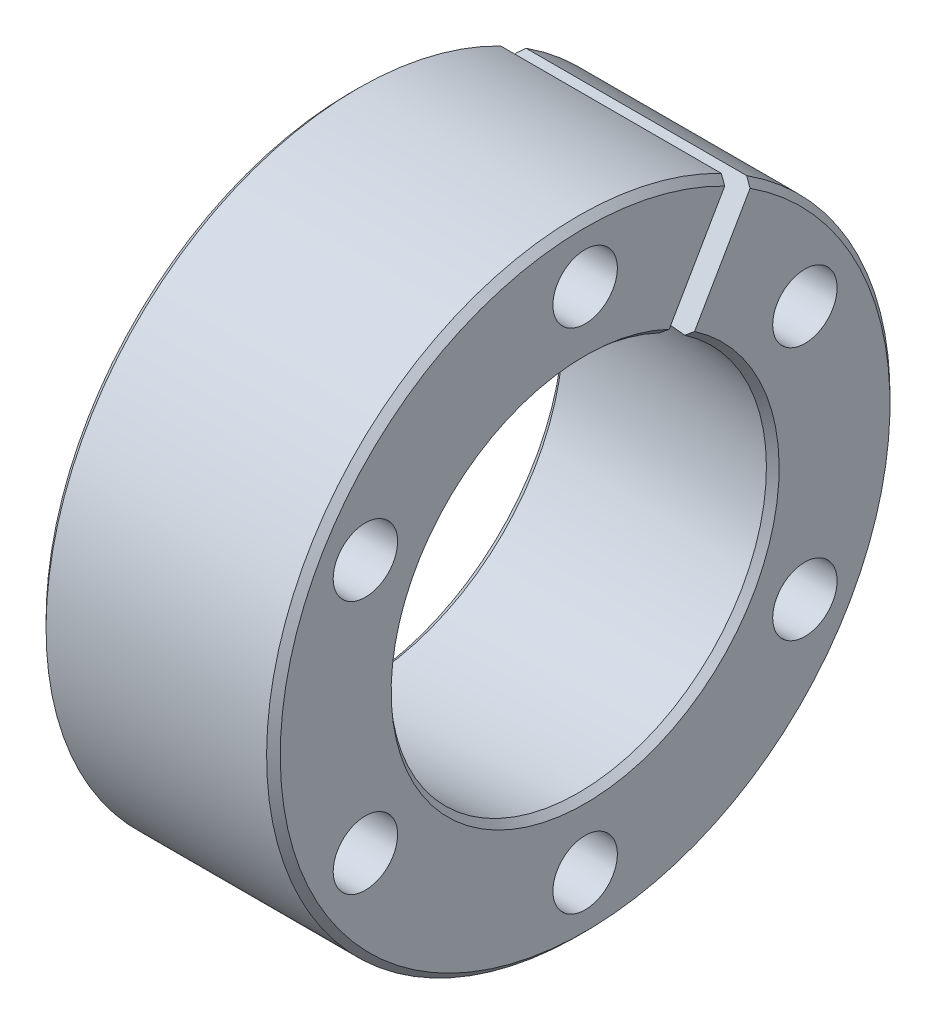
ISO-10303-21;
HEADER;
FILE_DESCRIPTION(('STEP AP214'),'2;1');
FILE_NAME('part.step','',(''),(''),'','','');
FILE_SCHEMA(('AUTOMOTIVE_DESIGN { 1 0 10303 214 1 1 1 1 }'));
ENDSEC;
DATA;
#1=APPLICATION_CONTEXT('core data for automotive mechanical design processes');
#2=APPLICATION_PROTOCOL_DEFINITION('international standard','automotive_design',2000,#1);
#3=PRODUCT_CONTEXT('',#1,'mechanical');
#4=PRODUCT('Part','Part','',(#3));
#5=PRODUCT_RELATED_PRODUCT_CATEGORY('part','',(#4));
#6=PRODUCT_DEFINITION_FORMATION('','',#4);
#7=PRODUCT_DEFINITION_CONTEXT('part definition',#1,'design');
#8=PRODUCT_DEFINITION('design','',#6,#7);
#9=PRODUCT_DEFINITION_SHAPE('','',#8);
#10=(LENGTH_UNIT() NAMED_UNIT(*) SI_UNIT(.MILLI.,.METRE.));
#11=(NAMED_UNIT(*) PLANE_ANGLE_UNIT() SI_UNIT($,.RADIAN.));
#12=(NAMED_UNIT(*) SI_UNIT($,.STERADIAN.) SOLID_ANGLE_UNIT());
#13=UNCERTAINTY_MEASURE_WITH_UNIT(LENGTH_MEASURE(1.E-05),#10,'distance_accuracy_value','');
#14=(GEOMETRIC_REPRESENTATION_CONTEXT(3) GLOBAL_UNCERTAINTY_ASSIGNED_CONTEXT((#13)) GLOBAL_UNIT_ASSIGNED_CONTEXT((#10,
#11,#12)) REPRESENTATION_CONTEXT('',''));
#15=CARTESIAN_POINT('',(0.,0.,0.));
#16=DIRECTION('',(0.,0.,1.));
#17=DIRECTION('',(1.,0.,0.));
#18=AXIS2_PLACEMENT_3D('',#15,#16,#17);
#19=CARTESIAN_POINT('',(0.,0.,0.));
#20=DIRECTION('',(-1.,0.,0.));
#21=DIRECTION('',(0.,0.,1.));
#22=AXIS2_PLACEMENT_3D('',#19,#20,#21);
#23=CYLINDRICAL_SURFACE('',#22,15.97);
#24=CARTESIAN_POINT('',(11.65,0.,0.));
#25=DIRECTION('',(-1.,0.,0.));
#26=DIRECTION('',(0.,0.,1.));
#27=AXIS2_PLACEMENT_3D('',#24,#25,#26);
#28=CIRCLE('',#27,15.97);
#29=CARTESIAN_POINT('',(11.65,13.4401655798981,-8.62570861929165));
#30=VERTEX_POINT('',#29);
#31=CARTESIAN_POINT('',(11.65,14.1901655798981,-7.32667051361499));
#32=VERTEX_POINT('',#31);
#33=EDGE_CURVE('E146',#30,#32,#28,.T.);
#34=ORIENTED_EDGE('',*,*,#33,.T.);
#35=DIRECTION('',(-1.,0.,0.));
#36=VECTOR('',#35,1.);
#37=CARTESIAN_POINT('',(0.,14.1901655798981,-7.32667051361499));
#38=LINE('',#37,#36);
#39=CARTESIAN_POINT('',(0.350000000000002,14.1901655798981,-7.32667051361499));
#40=VERTEX_POINT('',#39);
#41=EDGE_CURVE('E119',#32,#40,#38,.T.);
#42=ORIENTED_EDGE('',*,*,#41,.T.);
#43=CARTESIAN_POINT('',(0.35,0.,0.));
#44=DIRECTION('',(1.,0.,0.));
#45=DIRECTION('',(0.,0.,-1.));
#46=AXIS2_PLACEMENT_3D('',#43,#44,#45);
#47=CIRCLE('',#46,15.97);
#48=CARTESIAN_POINT('',(0.35,13.4401655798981,-8.62570861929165));
#49=VERTEX_POINT('',#48);
#50=EDGE_CURVE('E138',#40,#49,#47,.T.);
#51=ORIENTED_EDGE('',*,*,#50,.T.);
#52=DIRECTION('',(-1.,0.,0.));
#53=VECTOR('',#52,1.);
#54=CARTESIAN_POINT('',(0.,13.4401655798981,-8.62570861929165));
#55=LINE('',#54,#53);
#56=EDGE_CURVE('E129',#30,#49,#55,.T.);
#57=ORIENTED_EDGE('',*,*,#56,.F.);
#58=EDGE_LOOP('',(#34,#42,#51,#57));
#59=FACE_BOUND('',#58,.T.);
#60=ADVANCED_FACE('F39',(#59),#23,.T.);
#61=CARTESIAN_POINT('',(0.,10.4724573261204,0.));
#62=DIRECTION('',(1.,0.,0.));
#63=DIRECTION('',(0.,0.,-1.));
#64=AXIS2_PLACEMENT_3D('',#61,#62,#63);
#65=PLANE('',#64);
#66=CARTESIAN_POINT('',(0.,6.50000000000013,11.2583302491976));
#67=DIRECTION('',(-1.,0.,0.));
#68=DIRECTION('',(0.,0.,1.));
#69=AXIS2_PLACEMENT_3D('',#66,#67,#68);
#70=CIRCLE('',#69,1.65);
#71=CARTESIAN_POINT('',(0.,6.50000000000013,12.9083302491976));
#72=VERTEX_POINT('',#71);
#73=EDGE_CURVE('E220',#72,#72,#70,.T.);
#74=ORIENTED_EDGE('',*,*,#73,.F.);
#75=EDGE_LOOP('',(#74));
#76=FACE_BOUND('',#75,.T.);
#77=CARTESIAN_POINT('',(0.,-6.49999999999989,11.2583302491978));
#78=DIRECTION('',(-1.,0.,0.));
#79=DIRECTION('',(0.,0.,1.));
#80=AXIS2_PLACEMENT_3D('',#77,#78,#79);
#81=CIRCLE('',#80,1.65);
#82=CARTESIAN_POINT('',(0.,-6.49999999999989,12.9083302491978));
#83=VERTEX_POINT('',#82);
#84=EDGE_CURVE('E231',#83,#83,#81,.T.);
#85=ORIENTED_EDGE('',*,*,#84,.F.);
#86=EDGE_LOOP('',(#85));
#87=FACE_BOUND('',#86,.T.);
#88=CARTESIAN_POINT('',(0.,-13.,0.));
#89=DIRECTION('',(-1.,0.,0.));
#90=DIRECTION('',(0.,0.,1.));
#91=AXIS2_PLACEMENT_3D('',#88,#89,#90);
#92=CIRCLE('',#91,1.65);
#93=CARTESIAN_POINT('',(0.,-13.,1.65));
#94=VERTEX_POINT('',#93);
#95=EDGE_CURVE('E237',#94,#94,#92,.T.);
#96=ORIENTED_EDGE('',*,*,#95,.F.);
#97=EDGE_LOOP('',(#96));
#98=FACE_BOUND('',#97,.T.);
#99=CARTESIAN_POINT('',(0.,-6.50000000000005,-11.2583302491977));
#100=DIRECTION('',(-1.,0.,0.));
#101=DIRECTION('',(0.,0.,1.));
#102=AXIS2_PLACEMENT_3D('',#99,#100,#101);
#103=CIRCLE('',#102,1.65);
#104=CARTESIAN_POINT('',(0.,-6.50000000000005,-9.60833024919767));
#105=VERTEX_POINT('',#104);
#106=EDGE_CURVE('E243',#105,#105,#103,.T.);
#107=ORIENTED_EDGE('',*,*,#106,.F.);
#108=EDGE_LOOP('',(#107));
#109=FACE_BOUND('',#108,.T.);
#110=CARTESIAN_POINT('',(0.,6.49999999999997,-11.2583302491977));
#111=DIRECTION('',(-1.,0.,0.));
#112=DIRECTION('',(0.,0.,1.));
#113=AXIS2_PLACEMENT_3D('',#110,#111,#112);
#114=CIRCLE('',#113,1.65);
#115=CARTESIAN_POINT('',(0.,6.49999999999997,-9.60833024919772));
#116=VERTEX_POINT('',#115);
#117=EDGE_CURVE('E249',#116,#116,#114,.T.);
#118=ORIENTED_EDGE('',*,*,#117,.F.);
#119=EDGE_LOOP('',(#118));
#120=FACE_BOUND('',#119,.T.);
#121=CARTESIAN_POINT('',(0.,13.,0.));
#122=DIRECTION('',(-1.,0.,0.));
#123=DIRECTION('',(0.,0.,1.));
#124=AXIS2_PLACEMENT_3D('',#121,#122,#123);
#125=CIRCLE('',#124,1.65);
#126=CARTESIAN_POINT('',(0.,13.,1.65));
#127=VERTEX_POINT('',#126);
#128=EDGE_CURVE('E255',#127,#127,#125,.T.);
#129=ORIENTED_EDGE('',*,*,#128,.F.);
#130=EDGE_LOOP('',(#129));
#131=FACE_BOUND('',#130,.T.);
#132=DIRECTION('',(0.,-0.866025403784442,0.499999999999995));
#133=VECTOR('',#132,1.);
#134=CARTESIAN_POINT('',(0.,0.374999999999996,0.649519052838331));
#135=LINE('',#134,#133);
#136=CARTESIAN_POINT('',(0.,9.76839508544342,-4.77376012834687));
#137=VERTEX_POINT('',#136);
#138=CARTESIAN_POINT('',(0.,13.8867143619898,-7.1514728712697));
#139=VERTEX_POINT('',#138);
#140=EDGE_CURVE('E270',#137,#139,#135,.F.);
#141=ORIENTED_EDGE('',*,*,#140,.F.);
#142=CARTESIAN_POINT('',(0.,0.,0.));
#143=DIRECTION('',(1.,0.,0.));
#144=DIRECTION('',(0.,0.,-1.));
#145=AXIS2_PLACEMENT_3D('',#142,#143,#144);
#146=CIRCLE('',#145,10.8724573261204);
#147=CARTESIAN_POINT('',(0.,9.01839508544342,-6.07279823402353));
#148=VERTEX_POINT('',#147);
#149=EDGE_CURVE('E54',#137,#148,#146,.T.);
#150=ORIENTED_EDGE('',*,*,#149,.T.);
#151=DIRECTION('',(0.,-0.866025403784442,0.499999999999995));
#152=VECTOR('',#151,1.);
#153=CARTESIAN_POINT('',(0.,13.1367143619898,-8.45051097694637));
#154=LINE('',#153,#152);
#155=CARTESIAN_POINT('',(0.,13.1367143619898,-8.45051097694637));
#156=VERTEX_POINT('',#155);
#157=EDGE_CURVE('E286',#148,#156,#154,.F.);
#158=ORIENTED_EDGE('',*,*,#157,.T.);
#159=CARTESIAN_POINT('',(0.,0.,0.));
#160=DIRECTION('',(1.,0.,0.));
#161=DIRECTION('',(0.,0.,-1.));
#162=AXIS2_PLACEMENT_3D('',#159,#160,#161);
#163=CIRCLE('',#162,15.62);
#164=EDGE_CURVE('E149',#156,#139,#163,.F.);
#165=ORIENTED_EDGE('',*,*,#164,.T.);
#166=EDGE_LOOP('',(#141,#150,#158,#165));
#167=FACE_BOUND('',#166,.T.);
#168=ADVANCED_FACE('F209',(#76,#87,#98,#109,#120,#131,#167),#65,.F.);
#169=CARTESIAN_POINT('',(12.,15.97,0.));
#170=DIRECTION('',(-1.,0.,0.));
#171=DIRECTION('',(0.,0.,1.));
#172=AXIS2_PLACEMENT_3D('',#169,#170,#171);
#173=PLANE('',#172);
#174=CARTESIAN_POINT('',(12.,6.50000000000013,11.2583302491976));
#175=DIRECTION('',(-1.,0.,0.));
#176=DIRECTION('',(0.,0.,1.));
#177=AXIS2_PLACEMENT_3D('',#174,#175,#176);
#178=CIRCLE('',#177,1.65);
#179=CARTESIAN_POINT('',(12.,6.50000000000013,12.9083302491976));
#180=VERTEX_POINT('',#179);
#181=EDGE_CURVE('E228',#180,#180,#178,.T.);
#182=ORIENTED_EDGE('',*,*,#181,.T.);
#183=EDGE_LOOP('',(#182));
#184=FACE_BOUND('',#183,.T.);
#185=CARTESIAN_POINT('',(12.,-6.49999999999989,11.2583302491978));
#186=DIRECTION('',(-1.,0.,0.));
#187=DIRECTION('',(0.,0.,1.));
#188=AXIS2_PLACEMENT_3D('',#185,#186,#187);
#189=CIRCLE('',#188,1.65);
#190=CARTESIAN_POINT('',(12.,-6.49999999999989,12.9083302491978));
#191=VERTEX_POINT('',#190);
#192=EDGE_CURVE('E234',#191,#191,#189,.T.);
#193=ORIENTED_EDGE('',*,*,#192,.T.);
#194=EDGE_LOOP('',(#193));
#195=FACE_BOUND('',#194,.T.);
#196=CARTESIAN_POINT('',(12.,-13.,0.));
#197=DIRECTION('',(-1.,0.,0.));
#198=DIRECTION('',(0.,0.,1.));
#199=AXIS2_PLACEMENT_3D('',#196,#197,#198);
#200=CIRCLE('',#199,1.65);
#201=CARTESIAN_POINT('',(12.,-13.,1.65));
#202=VERTEX_POINT('',#201);
#203=EDGE_CURVE('E240',#202,#202,#200,.T.);
#204=ORIENTED_EDGE('',*,*,#203,.T.);
#205=EDGE_LOOP('',(#204));
#206=FACE_BOUND('',#205,.T.);
#207=CARTESIAN_POINT('',(12.,-6.50000000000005,-11.2583302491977));
#208=DIRECTION('',(-1.,0.,0.));
#209=DIRECTION('',(0.,0.,1.));
#210=AXIS2_PLACEMENT_3D('',#207,#208,#209);
#211=CIRCLE('',#210,1.65);
#212=CARTESIAN_POINT('',(12.,-6.50000000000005,-9.60833024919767));
#213=VERTEX_POINT('',#212);
#214=EDGE_CURVE('E246',#213,#213,#211,.T.);
#215=ORIENTED_EDGE('',*,*,#214,.T.);
#216=EDGE_LOOP('',(#215));
#217=FACE_BOUND('',#216,.T.);
#218=CARTESIAN_POINT('',(12.,6.49999999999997,-11.2583302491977));
#219=DIRECTION('',(-1.,0.,0.));
#220=DIRECTION('',(0.,0.,1.));
#221=AXIS2_PLACEMENT_3D('',#218,#219,#220);
#222=CIRCLE('',#221,1.65);
#223=CARTESIAN_POINT('',(12.,6.49999999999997,-9.60833024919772));
#224=VERTEX_POINT('',#223);
#225=EDGE_CURVE('E252',#224,#224,#222,.T.);
#226=ORIENTED_EDGE('',*,*,#225,.T.);
#227=EDGE_LOOP('',(#226));
#228=FACE_BOUND('',#227,.T.);
#229=CARTESIAN_POINT('',(12.,13.,0.));
#230=DIRECTION('',(-1.,0.,0.));
#231=DIRECTION('',(0.,0.,1.));
#232=AXIS2_PLACEMENT_3D('',#229,#230,#231);
#233=CIRCLE('',#232,1.65);
#234=CARTESIAN_POINT('',(12.,13.,1.65));
#235=VERTEX_POINT('',#234);
#236=EDGE_CURVE('E140',#235,#235,#233,.T.);
#237=ORIENTED_EDGE('',*,*,#236,.T.);
#238=EDGE_LOOP('',(#237));
#239=FACE_BOUND('',#238,.T.);
#240=CARTESIAN_POINT('',(12.,0.,0.));
#241=DIRECTION('',(-1.,0.,0.));
#242=DIRECTION('',(0.,0.,1.));
#243=AXIS2_PLACEMENT_3D('',#240,#241,#242);
#244=CIRCLE('',#243,9.93971434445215);
#245=CARTESIAN_POINT('',(12.,8.20850545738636,-5.6052082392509));
#246=VERTEX_POINT('',#245);
#247=CARTESIAN_POINT('',(12.,8.95850545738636,-4.30617013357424));
#248=VERTEX_POINT('',#247);
#249=EDGE_CURVE('E126',#246,#248,#244,.T.);
#250=ORIENTED_EDGE('',*,*,#249,.T.);
#251=DIRECTION('',(0.,0.866025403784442,-0.499999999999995));
#252=VECTOR('',#251,1.);
#253=CARTESIAN_POINT('',(12.,0.374999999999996,0.649519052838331));
#254=LINE('',#253,#252);
#255=CARTESIAN_POINT('',(12.,13.8867143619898,-7.15147287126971));
#256=VERTEX_POINT('',#255);
#257=EDGE_CURVE('E130',#248,#256,#254,.T.);
#258=ORIENTED_EDGE('',*,*,#257,.T.);
#259=CARTESIAN_POINT('',(12.,0.,0.));
#260=DIRECTION('',(-1.,0.,0.));
#261=DIRECTION('',(0.,0.,1.));
#262=AXIS2_PLACEMENT_3D('',#259,#260,#261);
#263=CIRCLE('',#262,15.62);
#264=CARTESIAN_POINT('',(12.,13.1367143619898,-8.45051097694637));
#265=VERTEX_POINT('',#264);
#266=EDGE_CURVE('E128',#256,#265,#263,.F.);
#267=ORIENTED_EDGE('',*,*,#266,.T.);
#268=DIRECTION('',(0.,0.866025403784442,-0.499999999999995));
#269=VECTOR('',#268,1.);
#270=CARTESIAN_POINT('',(12.,-0.374999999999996,-0.649519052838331));
#271=LINE('',#270,#269);
#272=EDGE_CURVE('E111',#246,#265,#271,.T.);
#273=ORIENTED_EDGE('',*,*,#272,.F.);
#274=EDGE_LOOP('',(#250,#258,#267,#273));
#275=FACE_BOUND('',#274,.T.);
#276=ADVANCED_FACE('F124',(#184,#195,#206,#217,#228,#239,#275),#173,.F.);
#277=CARTESIAN_POINT('',(0.,0.,0.));
#278=DIRECTION('',(-1.,0.,0.));
#279=DIRECTION('',(0.,0.,1.));
#280=AXIS2_PLACEMENT_3D('',#277,#278,#279);
#281=CONICAL_SURFACE('',#280,10.4724573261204,0.0715584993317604);
#282=CARTESIAN_POINT('',(-0.000199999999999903,8.67113851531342,-5.87230955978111));
#283=CARTESIAN_POINT('',(1.94168494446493,8.55028200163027,-5.80253301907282));
#284=CARTESIAN_POINT('',(3.88356872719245,8.42941149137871,-5.73274839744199));
#285=CARTESIAN_POINT('',(7.76733396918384,8.18764247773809,-5.59316299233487));
#286=CARTESIAN_POINT('',(9.70921542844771,8.06674397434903,-5.52336220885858));
#287=CARTESIAN_POINT('',(11.6510957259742,7.94583147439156,-5.45355334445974));
#288=B_SPLINE_CURVE_WITH_KNOTS('',3,(#282,#283,#284,#285,#286,#287),.UNSPECIFIED.,.F.,.F.,(4,2,
4),(0.,5.84067888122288,11.6813577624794),.UNSPECIFIED.);
#289=CARTESIAN_POINT('',(0.430886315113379,8.64430866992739,-5.85681934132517));
#290=VERTEX_POINT('',#289);
#291=CARTESIAN_POINT('',(11.6508957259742,7.9458439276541,-5.45356053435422));
#292=VERTEX_POINT('',#291);
#293=EDGE_CURVE('E114',#290,#292,#288,.T.);
#294=ORIENTED_EDGE('',*,*,#293,.F.);
#295=CARTESIAN_POINT('',(0.430886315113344,0.,0.));
#296=DIRECTION('',(1.,0.,0.));
#297=DIRECTION('',(0.,0.,-1.));
#298=AXIS2_PLACEMENT_3D('',#295,#296,#297);
#299=CIRCLE('',#298,10.441571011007);
#300=CARTESIAN_POINT('',(0.430886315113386,9.39430866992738,-4.5577812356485));
#301=VERTEX_POINT('',#300);
#302=EDGE_CURVE('E279',#290,#301,#299,.F.);
#303=ORIENTED_EDGE('',*,*,#302,.T.);
#304=CARTESIAN_POINT('',(-0.000199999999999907,9.42113851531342,-4.57327145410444));
#305=CARTESIAN_POINT('',(1.94168494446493,9.30028200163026,-4.50349491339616));
#306=CARTESIAN_POINT('',(3.88356872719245,9.1794114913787,-4.43371029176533));
#307=CARTESIAN_POINT('',(7.76733396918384,8.93764247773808,-4.29412488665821));
#308=CARTESIAN_POINT('',(9.70921542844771,8.81674397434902,-4.22432410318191));
#309=CARTESIAN_POINT('',(11.6510957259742,8.69583147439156,-4.15451523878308));
#310=B_SPLINE_CURVE_WITH_KNOTS('',3,(#304,#305,#306,#307,#308,#309),.UNSPECIFIED.,.F.,.F.,(4,2,
4),(0.,5.84067888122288,11.6813577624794),.UNSPECIFIED.);
#311=CARTESIAN_POINT('',(11.6508957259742,8.69584392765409,-4.15452242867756));
#312=VERTEX_POINT('',#311);
#313=EDGE_CURVE('E221',#301,#312,#310,.T.);
#314=ORIENTED_EDGE('',*,*,#313,.T.);
#315=CARTESIAN_POINT('',(11.6508957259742,0.,0.));
#316=DIRECTION('',(1.,0.,0.));
#317=DIRECTION('',(0.,0.,-1.));
#318=AXIS2_PLACEMENT_3D('',#315,#316,#317);
#319=CIRCLE('',#318,9.63731073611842);
#320=EDGE_CURVE('E136',#312,#292,#319,.T.);
#321=ORIENTED_EDGE('',*,*,#320,.T.);
#322=EDGE_LOOP('',(#294,#303,#314,#321));
#323=FACE_BOUND('',#322,.T.);
#324=ADVANCED_FACE('F208',(#323),#281,.F.);
#325=CARTESIAN_POINT('',(12.,0.,0.));
#326=DIRECTION('',(1.,0.,0.));
#327=DIRECTION('',(0.,0.,-1.));
#328=AXIS2_PLACEMENT_3D('',#325,#326,#327);
#329=CONICAL_SURFACE('',#328,9.93971434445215,0.713839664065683);
#330=CARTESIAN_POINT('',(12.0002,8.95865592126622,-4.30625700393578));
#331=CARTESIAN_POINT('',(11.9419469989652,8.91483112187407,-4.28095474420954));
#332=CARTESIAN_POINT('',(11.8836951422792,8.87100518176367,-4.25565182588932));
#333=CARTESIAN_POINT('',(11.7671937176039,8.78335102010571,-4.2050446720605));
#334=CARTESIAN_POINT('',(11.7089441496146,8.73952279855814,-4.17974043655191));
#335=CARTESIAN_POINT('',(11.6506957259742,8.69569343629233,-4.15443554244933));
#336=B_SPLINE_CURVE_WITH_KNOTS('',3,(#330,#331,#332,#333,#334,#335),.UNSPECIFIED.,.F.,.F.,(4,2,
4),(0.,0.231490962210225,0.462981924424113),.UNSPECIFIED.);
#337=EDGE_CURVE('E135',#248,#312,#336,.T.);
#338=ORIENTED_EDGE('',*,*,#337,.F.);
#339=ORIENTED_EDGE('',*,*,#249,.F.);
#340=CARTESIAN_POINT('',(12.0002,8.20865592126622,-5.60529510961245));
#341=CARTESIAN_POINT('',(11.9419469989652,8.16483112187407,-5.5799928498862));
#342=CARTESIAN_POINT('',(11.8836951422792,8.12100518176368,-5.55468993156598));
#343=CARTESIAN_POINT('',(11.7671937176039,8.03335102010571,-5.50408277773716));
#344=CARTESIAN_POINT('',(11.7089441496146,7.98952279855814,-5.47877854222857));
#345=CARTESIAN_POINT('',(11.6506957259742,7.94569343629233,-5.453473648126));
#346=B_SPLINE_CURVE_WITH_KNOTS('',3,(#340,#341,#342,#343,#344,#345),.UNSPECIFIED.,.F.,.F.,(4,2,
4),(0.,0.231490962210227,0.462981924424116),.UNSPECIFIED.);
#347=EDGE_CURVE('E108',#246,#292,#346,.T.);
#348=ORIENTED_EDGE('',*,*,#347,.T.);
#349=ORIENTED_EDGE('',*,*,#320,.F.);
#350=EDGE_LOOP('',(#338,#339,#348,#349));
#351=FACE_BOUND('',#350,.T.);
#352=ADVANCED_FACE('F133',(#351),#329,.F.);
#353=CARTESIAN_POINT('',(11.65,0.,0.));
#354=DIRECTION('',(-1.,0.,0.));
#355=DIRECTION('',(0.,0.,1.));
#356=AXIS2_PLACEMENT_3D('',#353,#354,#355);
#357=CONICAL_SURFACE('',#356,15.97,0.785398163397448);
#358=CARTESIAN_POINT('',(11.6498,14.1903389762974,-7.32677062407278));
#359=CARTESIAN_POINT('',(11.7082007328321,14.1397066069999,-7.29753801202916));
#360=CARTESIAN_POINT('',(11.7666010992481,14.0890739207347,-7.26830521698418));
#361=CARTESIAN_POINT('',(11.8834010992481,13.9878079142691,-7.20983926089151));
#362=CARTESIAN_POINT('',(11.9418007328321,13.9371745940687,-7.18060609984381));
#363=CARTESIAN_POINT('',(12.0002,13.8865409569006,-7.15137275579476));
#364=B_SPLINE_CURVE_WITH_KNOTS('',3,(#358,#359,#360,#361,#362,#363),.UNSPECIFIED.,.F.,.F.,(4,2,
4),(0.,0.247910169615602,0.495820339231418),.UNSPECIFIED.);
#365=EDGE_CURVE('E273',#32,#256,#364,.T.);
#366=ORIENTED_EDGE('',*,*,#365,.F.);
#367=ORIENTED_EDGE('',*,*,#33,.F.);
#368=CARTESIAN_POINT('',(11.6498,13.4403389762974,-8.62580872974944));
#369=CARTESIAN_POINT('',(11.7082007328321,13.3897066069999,-8.59657611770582));
#370=CARTESIAN_POINT('',(11.7666010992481,13.3390739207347,-8.56734332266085));
#371=CARTESIAN_POINT('',(11.8834010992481,13.2378079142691,-8.50887736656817));
#372=CARTESIAN_POINT('',(11.9418007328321,13.1871745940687,-8.47964420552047));
#373=CARTESIAN_POINT('',(12.0002,13.1365409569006,-8.45041086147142));
#374=B_SPLINE_CURVE_WITH_KNOTS('',3,(#368,#369,#370,#371,#372,#373),.UNSPECIFIED.,.F.,.F.,(4,2,
4),(0.,0.247910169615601,0.495820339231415),.UNSPECIFIED.);
#375=EDGE_CURVE('E181',#30,#265,#374,.T.);
#376=ORIENTED_EDGE('',*,*,#375,.T.);
#377=ORIENTED_EDGE('',*,*,#266,.F.);
#378=EDGE_LOOP('',(#366,#367,#376,#377));
#379=FACE_BOUND('',#378,.T.);
#380=ADVANCED_FACE('F207',(#379),#357,.T.);
#381=CARTESIAN_POINT('',(0.,0.,0.));
#382=DIRECTION('',(1.,0.,0.));
#383=DIRECTION('',(0.,0.,-1.));
#384=AXIS2_PLACEMENT_3D('',#381,#382,#383);
#385=CONICAL_SURFACE('',#384,15.62,0.785398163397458);
#386=CARTESIAN_POINT('',(-0.000200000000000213,13.8865409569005,-7.15137275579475));
#387=CARTESIAN_POINT('',(0.0581992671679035,13.9371745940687,-7.18060609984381));
#388=CARTESIAN_POINT('',(0.116598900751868,13.9878079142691,-7.20983926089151));
#389=CARTESIAN_POINT('',(0.233398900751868,14.0890739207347,-7.26830521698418));
#390=CARTESIAN_POINT('',(0.291799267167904,14.1397066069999,-7.29753801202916));
#391=CARTESIAN_POINT('',(0.350200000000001,14.1903389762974,-7.32677062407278));
#392=B_SPLINE_CURVE_WITH_KNOTS('',3,(#386,#387,#388,#389,#390,#391),.UNSPECIFIED.,.F.,.F.,(4,2,
4),(0.,0.247910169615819,0.495820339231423),.UNSPECIFIED.);
#393=EDGE_CURVE('E159',#139,#40,#392,.T.);
#394=ORIENTED_EDGE('',*,*,#393,.F.);
#395=ORIENTED_EDGE('',*,*,#164,.F.);
#396=CARTESIAN_POINT('',(-0.000200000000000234,13.1365409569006,-8.45041086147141));
#397=CARTESIAN_POINT('',(0.0581992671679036,13.1871745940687,-8.47964420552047));
#398=CARTESIAN_POINT('',(0.116598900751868,13.2378079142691,-8.50887736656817));
#399=CARTESIAN_POINT('',(0.233398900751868,13.3390739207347,-8.56734332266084));
#400=CARTESIAN_POINT('',(0.291799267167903,13.3897066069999,-8.59657611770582));
#401=CARTESIAN_POINT('',(0.350199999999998,13.4403389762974,-8.62580872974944));
#402=B_SPLINE_CURVE_WITH_KNOTS('',3,(#396,#397,#398,#399,#400,#401),.UNSPECIFIED.,.F.,.F.,(4,2,
4),(0.,0.247910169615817,0.49582033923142),.UNSPECIFIED.);
#403=EDGE_CURVE('E152',#156,#49,#402,.T.);
#404=ORIENTED_EDGE('',*,*,#403,.T.);
#405=ORIENTED_EDGE('',*,*,#50,.F.);
#406=EDGE_LOOP('',(#394,#395,#404,#405));
#407=FACE_BOUND('',#406,.T.);
#408=ADVANCED_FACE('F167',(#407),#385,.T.);
#409=CARTESIAN_POINT('',(0.,13.,0.));
#410=DIRECTION('',(-1.,0.,0.));
#411=DIRECTION('',(0.,0.,1.));
#412=AXIS2_PLACEMENT_3D('',#409,#410,#411);
#413=CYLINDRICAL_SURFACE('',#412,1.65);
#414=ORIENTED_EDGE('',*,*,#236,.F.);
#415=EDGE_LOOP('',(#414));
#416=FACE_BOUND('',#415,.T.);
#417=ORIENTED_EDGE('',*,*,#128,.T.);
#418=EDGE_LOOP('',(#417));
#419=FACE_BOUND('',#418,.T.);
#420=ADVANCED_FACE('F261',(#416,#419),#413,.F.);
#421=CARTESIAN_POINT('',(0.,6.49999999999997,-11.2583302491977));
#422=DIRECTION('',(-1.,0.,0.));
#423=DIRECTION('',(0.,0.,1.));
#424=AXIS2_PLACEMENT_3D('',#421,#422,#423);
#425=CYLINDRICAL_SURFACE('',#424,1.65);
#426=ORIENTED_EDGE('',*,*,#225,.F.);
#427=EDGE_LOOP('',(#426));
#428=FACE_BOUND('',#427,.T.);
#429=ORIENTED_EDGE('',*,*,#117,.T.);
#430=EDGE_LOOP('',(#429));
#431=FACE_BOUND('',#430,.T.);
#432=ADVANCED_FACE('F264',(#428,#431),#425,.F.);
#433=CARTESIAN_POINT('',(0.,-6.50000000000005,-11.2583302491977));
#434=DIRECTION('',(-1.,0.,0.));
#435=DIRECTION('',(0.,0.,1.));
#436=AXIS2_PLACEMENT_3D('',#433,#434,#435);
#437=CYLINDRICAL_SURFACE('',#436,1.65);
#438=ORIENTED_EDGE('',*,*,#214,.F.);
#439=EDGE_LOOP('',(#438));
#440=FACE_BOUND('',#439,.T.);
#441=ORIENTED_EDGE('',*,*,#106,.T.);
#442=EDGE_LOOP('',(#441));
#443=FACE_BOUND('',#442,.T.);
#444=ADVANCED_FACE('F314',(#440,#443),#437,.F.);
#445=CARTESIAN_POINT('',(0.,-13.,0.));
#446=DIRECTION('',(-1.,0.,0.));
#447=DIRECTION('',(0.,0.,1.));
#448=AXIS2_PLACEMENT_3D('',#445,#446,#447);
#449=CYLINDRICAL_SURFACE('',#448,1.65);
#450=ORIENTED_EDGE('',*,*,#203,.F.);
#451=EDGE_LOOP('',(#450));
#452=FACE_BOUND('',#451,.T.);
#453=ORIENTED_EDGE('',*,*,#95,.T.);
#454=EDGE_LOOP('',(#453));
#455=FACE_BOUND('',#454,.T.);
#456=ADVANCED_FACE('F318',(#452,#455),#449,.F.);
#457=CARTESIAN_POINT('',(0.,-6.49999999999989,11.2583302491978));
#458=DIRECTION('',(-1.,0.,0.));
#459=DIRECTION('',(0.,0.,1.));
#460=AXIS2_PLACEMENT_3D('',#457,#458,#459);
#461=CYLINDRICAL_SURFACE('',#460,1.65);
#462=ORIENTED_EDGE('',*,*,#192,.F.);
#463=EDGE_LOOP('',(#462));
#464=FACE_BOUND('',#463,.T.);
#465=ORIENTED_EDGE('',*,*,#84,.T.);
#466=EDGE_LOOP('',(#465));
#467=FACE_BOUND('',#466,.T.);
#468=ADVANCED_FACE('F322',(#464,#467),#461,.F.);
#469=CARTESIAN_POINT('',(0.,6.50000000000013,11.2583302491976));
#470=DIRECTION('',(-1.,0.,0.));
#471=DIRECTION('',(0.,0.,1.));
#472=AXIS2_PLACEMENT_3D('',#469,#470,#471);
#473=CYLINDRICAL_SURFACE('',#472,1.65);
#474=ORIENTED_EDGE('',*,*,#181,.F.);
#475=EDGE_LOOP('',(#474));
#476=FACE_BOUND('',#475,.T.);
#477=ORIENTED_EDGE('',*,*,#73,.T.);
#478=EDGE_LOOP('',(#477));
#479=FACE_BOUND('',#478,.T.);
#480=ADVANCED_FACE('F173',(#476,#479),#473,.F.);
#481=CARTESIAN_POINT('',(12.,-0.374999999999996,-0.649519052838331));
#482=DIRECTION('',(0.,0.499999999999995,0.866025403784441));
#483=DIRECTION('',(0.,-0.866025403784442,0.499999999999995));
#484=AXIS2_PLACEMENT_3D('',#481,#482,#483);
#485=PLANE('',#484);
#486=ORIENTED_EDGE('',*,*,#157,.F.);
#487=CARTESIAN_POINT('',(0.,9.01839508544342,-6.07279823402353));
#488=CARTESIAN_POINT('',(0.0718180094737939,8.95605047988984,-6.03680355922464));
#489=CARTESIAN_POINT('',(0.143634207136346,8.89370430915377,-6.00080798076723));
#490=CARTESIAN_POINT('',(0.287262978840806,8.76900883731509,-5.92881501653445));
#491=CARTESIAN_POINT('',(0.359075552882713,8.70665953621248,-5.89281763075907));
#492=CARTESIAN_POINT('',(0.430886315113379,8.64430866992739,-5.85681934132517));
#493=B_SPLINE_CURVE_WITH_KNOTS('',3,(#487,#488,#489,#490,#491,#492),.UNSPECIFIED.,.F.,.F.,(4,2,
4),(0.,0.305061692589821,0.610123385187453),.UNSPECIFIED.);
#494=EDGE_CURVE('E11',#148,#290,#493,.T.);
#495=ORIENTED_EDGE('',*,*,#494,.T.);
#496=ORIENTED_EDGE('',*,*,#293,.T.);
#497=ORIENTED_EDGE('',*,*,#347,.F.);
#498=ORIENTED_EDGE('',*,*,#272,.T.);
#499=ORIENTED_EDGE('',*,*,#375,.F.);
#500=ORIENTED_EDGE('',*,*,#56,.T.);
#501=ORIENTED_EDGE('',*,*,#403,.F.);
#502=EDGE_LOOP('',(#486,#495,#496,#497,#498,#499,#500,#501));
#503=FACE_BOUND('',#502,.T.);
#504=ADVANCED_FACE('F110',(#503),#485,.T.);
#505=CARTESIAN_POINT('',(12.,0.374999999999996,0.649519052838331));
#506=DIRECTION('',(0.,0.499999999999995,0.866025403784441));
#507=DIRECTION('',(0.,-0.866025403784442,0.499999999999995));
#508=AXIS2_PLACEMENT_3D('',#505,#506,#507);
#509=PLANE('',#508);
#510=ORIENTED_EDGE('',*,*,#313,.F.);
#511=CARTESIAN_POINT('',(0.430886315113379,9.39430866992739,-4.5577812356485));
#512=CARTESIAN_POINT('',(0.359075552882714,9.45665953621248,-4.59377952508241));
#513=CARTESIAN_POINT('',(0.287262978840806,9.51900883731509,-4.62977691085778));
#514=CARTESIAN_POINT('',(0.143634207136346,9.64370430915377,-4.70176987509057));
#515=CARTESIAN_POINT('',(0.071818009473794,9.70605047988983,-4.73776545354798));
#516=CARTESIAN_POINT('',(0.,9.76839508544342,-4.77376012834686));
#517=B_SPLINE_CURVE_WITH_KNOTS('',3,(#511,#512,#513,#514,#515,#516),.UNSPECIFIED.,.F.,.F.,(4,2,
4),(0.,0.305061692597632,0.610123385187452),.UNSPECIFIED.);
#518=EDGE_CURVE('E68',#301,#137,#517,.T.);
#519=ORIENTED_EDGE('',*,*,#518,.T.);
#520=ORIENTED_EDGE('',*,*,#140,.T.);
#521=ORIENTED_EDGE('',*,*,#393,.T.);
#522=ORIENTED_EDGE('',*,*,#41,.F.);
#523=ORIENTED_EDGE('',*,*,#365,.T.);
#524=ORIENTED_EDGE('',*,*,#257,.F.);
#525=ORIENTED_EDGE('',*,*,#337,.T.);
#526=EDGE_LOOP('',(#510,#519,#520,#521,#522,#523,#524,#525));
#527=FACE_BOUND('',#526,.T.);
#528=ADVANCED_FACE('F172',(#527),#509,.F.);
#529=CARTESIAN_POINT('',(0.430886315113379,0.,0.));
#530=DIRECTION('',(-1.,0.,0.));
#531=DIRECTION('',(0.,0.,1.));
#532=AXIS2_PLACEMENT_3D('',#529,#530,#531);
#533=CONICAL_SURFACE('',#532,10.441571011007,0.785398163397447);
#534=ORIENTED_EDGE('',*,*,#494,.F.);
#535=ORIENTED_EDGE('',*,*,#149,.F.);
#536=ORIENTED_EDGE('',*,*,#518,.F.);
#537=ORIENTED_EDGE('',*,*,#302,.F.);
#538=EDGE_LOOP('',(#534,#535,#536,#537));
#539=FACE_BOUND('',#538,.T.);
#540=ADVANCED_FACE('F42',(#539),#533,.F.);
#541=CLOSED_SHELL('',(#60,#168,#276,#324,#352,#380,#408,#420,#432,#444,#456,#468,#480,#504,#528,#540));
#542=MANIFOLD_SOLID_BREP('B2',#541);
#543=ADVANCED_BREP_SHAPE_REPRESENTATION('',(#18,#542),#14);
#544=SHAPE_DEFINITION_REPRESENTATION(#9,#543);
ENDSEC;
END-ISO-10303-21;
